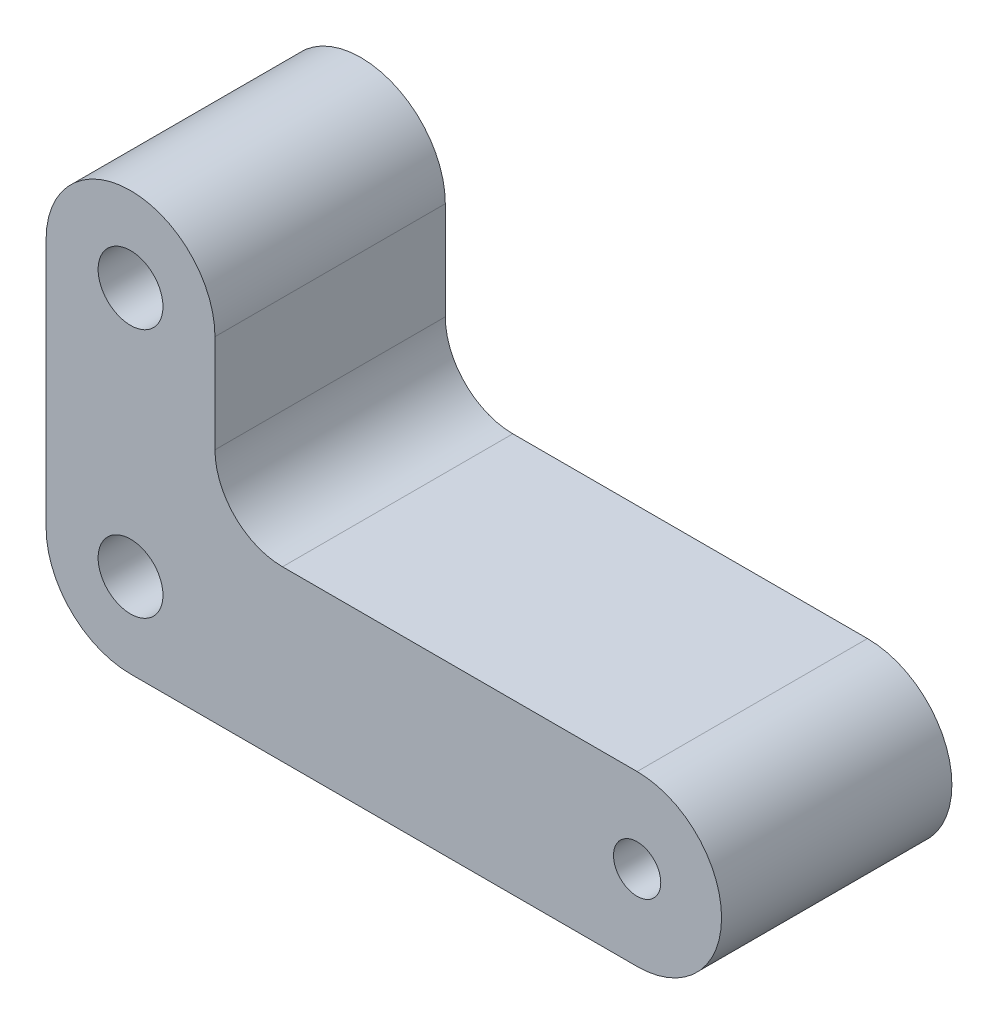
ISO-10303-21;
HEADER;
FILE_DESCRIPTION(('STEP AP214'),'2;1');
FILE_NAME('part.step','',(''),(''),'','','');
FILE_SCHEMA(('AUTOMOTIVE_DESIGN { 1 0 10303 214 1 1 1 1 }'));
ENDSEC;
DATA;
#1=APPLICATION_CONTEXT('core data for automotive mechanical design processes');
#2=APPLICATION_PROTOCOL_DEFINITION('international standard','automotive_design',2000,#1);
#3=PRODUCT_CONTEXT('',#1,'mechanical');
#4=PRODUCT('Part','Part','',(#3));
#5=PRODUCT_RELATED_PRODUCT_CATEGORY('part','',(#4));
#6=PRODUCT_DEFINITION_FORMATION('','',#4);
#7=PRODUCT_DEFINITION_CONTEXT('part definition',#1,'design');
#8=PRODUCT_DEFINITION('design','',#6,#7);
#9=PRODUCT_DEFINITION_SHAPE('','',#8);
#10=(LENGTH_UNIT() NAMED_UNIT(*) SI_UNIT(.MILLI.,.METRE.));
#11=(NAMED_UNIT(*) PLANE_ANGLE_UNIT() SI_UNIT($,.RADIAN.));
#12=(NAMED_UNIT(*) SI_UNIT($,.STERADIAN.) SOLID_ANGLE_UNIT());
#13=UNCERTAINTY_MEASURE_WITH_UNIT(LENGTH_MEASURE(1.E-05),#10,'distance_accuracy_value','');
#14=(GEOMETRIC_REPRESENTATION_CONTEXT(3) GLOBAL_UNCERTAINTY_ASSIGNED_CONTEXT((#13)) GLOBAL_UNIT_ASSIGNED_CONTEXT((#10,
#11,#12)) REPRESENTATION_CONTEXT('',''));
#15=CARTESIAN_POINT('',(0.,0.,0.));
#16=DIRECTION('',(0.,0.,1.));
#17=DIRECTION('',(1.,0.,0.));
#18=AXIS2_PLACEMENT_3D('',#15,#16,#17);
#19=CARTESIAN_POINT('',(81.915,40.767,8.6614));
#20=DIRECTION('',(0.,0.,-1.));
#21=DIRECTION('',(-1.,0.,0.));
#22=AXIS2_PLACEMENT_3D('',#19,#20,#21);
#23=CYLINDRICAL_SURFACE('',#22,2.54);
#24=CARTESIAN_POINT('',(81.915,40.767,0.));
#25=DIRECTION('',(0.,0.,-1.));
#26=DIRECTION('',(1.,0.,0.));
#27=AXIS2_PLACEMENT_3D('',#24,#25,#26);
#28=CIRCLE('',#27,2.54);
#29=CARTESIAN_POINT('',(81.915,38.227,0.));
#30=VERTEX_POINT('',#29);
#31=CARTESIAN_POINT('',(79.375,40.767,0.));
#32=VERTEX_POINT('',#31);
#33=EDGE_CURVE('E129',#30,#32,#28,.T.);
#34=ORIENTED_EDGE('',*,*,#33,.T.);
#35=DIRECTION('',(0.,0.,-1.));
#36=VECTOR('',#35,1.);
#37=CARTESIAN_POINT('',(79.375,40.767,8.6614));
#38=LINE('',#37,#36);
#39=CARTESIAN_POINT('',(79.375,40.767,8.6614));
#40=VERTEX_POINT('',#39);
#41=EDGE_CURVE('E11',#40,#32,#38,.T.);
#42=ORIENTED_EDGE('',*,*,#41,.F.);
#43=CARTESIAN_POINT('',(81.915,40.767,8.6614));
#44=DIRECTION('',(0.,0.,-1.));
#45=DIRECTION('',(1.,0.,0.));
#46=AXIS2_PLACEMENT_3D('',#43,#44,#45);
#47=CIRCLE('',#46,2.54);
#48=CARTESIAN_POINT('',(81.915,38.227,8.6614));
#49=VERTEX_POINT('',#48);
#50=EDGE_CURVE('E144',#49,#40,#47,.T.);
#51=ORIENTED_EDGE('',*,*,#50,.F.);
#52=DIRECTION('',(0.,0.,-1.));
#53=VECTOR('',#52,1.);
#54=CARTESIAN_POINT('',(81.915,38.227,8.6614));
#55=LINE('',#54,#53);
#56=EDGE_CURVE('E125',#49,#30,#55,.T.);
#57=ORIENTED_EDGE('',*,*,#56,.T.);
#58=EDGE_LOOP('',(#34,#42,#51,#57));
#59=FACE_BOUND('',#58,.T.);
#60=ADVANCED_FACE('F33',(#59),#23,.F.);
#61=CARTESIAN_POINT('',(79.375,44.45,8.6614));
#62=DIRECTION('',(-1.,0.,0.));
#63=DIRECTION('',(0.,0.,1.));
#64=AXIS2_PLACEMENT_3D('',#61,#62,#63);
#65=PLANE('',#64);
#66=DIRECTION('',(0.,1.,0.));
#67=VECTOR('',#66,1.);
#68=CARTESIAN_POINT('',(79.375,44.45,0.));
#69=LINE('',#68,#67);
#70=CARTESIAN_POINT('',(79.375,44.45,0.));
#71=VERTEX_POINT('',#70);
#72=EDGE_CURVE('E132',#32,#71,#69,.T.);
#73=ORIENTED_EDGE('',*,*,#72,.T.);
#74=DIRECTION('',(0.,0.,-1.));
#75=VECTOR('',#74,1.);
#76=CARTESIAN_POINT('',(79.375,44.45,8.6614));
#77=LINE('',#76,#75);
#78=CARTESIAN_POINT('',(79.375,44.45,8.6614));
#79=VERTEX_POINT('',#78);
#80=EDGE_CURVE('E41',#79,#71,#77,.T.);
#81=ORIENTED_EDGE('',*,*,#80,.F.);
#82=DIRECTION('',(0.,1.,0.));
#83=VECTOR('',#82,1.);
#84=CARTESIAN_POINT('',(79.375,44.45,8.6614));
#85=LINE('',#84,#83);
#86=EDGE_CURVE('E92',#40,#79,#85,.T.);
#87=ORIENTED_EDGE('',*,*,#86,.F.);
#88=ORIENTED_EDGE('',*,*,#41,.T.);
#89=EDGE_LOOP('',(#73,#81,#87,#88));
#90=FACE_BOUND('',#89,.T.);
#91=ADVANCED_FACE('F220',(#90),#65,.F.);
#92=CARTESIAN_POINT('',(76.2,44.45,8.6614));
#93=DIRECTION('',(0.,0.,-1.));
#94=DIRECTION('',(-1.,0.,0.));
#95=AXIS2_PLACEMENT_3D('',#92,#93,#94);
#96=CYLINDRICAL_SURFACE('',#95,3.175);
#97=CARTESIAN_POINT('',(76.2,44.45,0.));
#98=DIRECTION('',(0.,0.,1.));
#99=DIRECTION('',(1.,0.,0.));
#100=AXIS2_PLACEMENT_3D('',#97,#98,#99);
#101=CIRCLE('',#100,3.175);
#102=CARTESIAN_POINT('',(73.025,44.45,0.));
#103=VERTEX_POINT('',#102);
#104=EDGE_CURVE('E135',#71,#103,#101,.T.);
#105=ORIENTED_EDGE('',*,*,#104,.T.);
#106=DIRECTION('',(0.,0.,-1.));
#107=VECTOR('',#106,1.);
#108=CARTESIAN_POINT('',(73.025,44.45,8.6614));
#109=LINE('',#108,#107);
#110=CARTESIAN_POINT('',(73.025,44.45,8.6614));
#111=VERTEX_POINT('',#110);
#112=EDGE_CURVE('E151',#111,#103,#109,.T.);
#113=ORIENTED_EDGE('',*,*,#112,.F.);
#114=CARTESIAN_POINT('',(76.2,44.45,8.6614));
#115=DIRECTION('',(0.,0.,1.));
#116=DIRECTION('',(1.,0.,0.));
#117=AXIS2_PLACEMENT_3D('',#114,#115,#116);
#118=CIRCLE('',#117,3.175);
#119=EDGE_CURVE('E159',#79,#111,#118,.T.);
#120=ORIENTED_EDGE('',*,*,#119,.F.);
#121=ORIENTED_EDGE('',*,*,#80,.T.);
#122=EDGE_LOOP('',(#105,#113,#120,#121));
#123=FACE_BOUND('',#122,.T.);
#124=ADVANCED_FACE('F157',(#123),#96,.T.);
#125=CARTESIAN_POINT('',(73.025,35.052,8.6614));
#126=DIRECTION('',(1.,0.,0.));
#127=DIRECTION('',(0.,0.,-1.));
#128=AXIS2_PLACEMENT_3D('',#125,#126,#127);
#129=PLANE('',#128);
#130=DIRECTION('',(0.,-1.,0.));
#131=VECTOR('',#130,1.);
#132=CARTESIAN_POINT('',(73.025,35.052,0.));
#133=LINE('',#132,#131);
#134=CARTESIAN_POINT('',(73.025,35.052,0.));
#135=VERTEX_POINT('',#134);
#136=EDGE_CURVE('E137',#103,#135,#133,.T.);
#137=ORIENTED_EDGE('',*,*,#136,.T.);
#138=DIRECTION('',(0.,0.,-1.));
#139=VECTOR('',#138,1.);
#140=CARTESIAN_POINT('',(73.025,35.052,8.6614));
#141=LINE('',#140,#139);
#142=CARTESIAN_POINT('',(73.025,35.052,8.6614));
#143=VERTEX_POINT('',#142);
#144=EDGE_CURVE('E148',#143,#135,#141,.T.);
#145=ORIENTED_EDGE('',*,*,#144,.F.);
#146=DIRECTION('',(0.,-1.,0.));
#147=VECTOR('',#146,1.);
#148=CARTESIAN_POINT('',(73.025,35.052,8.6614));
#149=LINE('',#148,#147);
#150=EDGE_CURVE('E171',#111,#143,#149,.T.);
#151=ORIENTED_EDGE('',*,*,#150,.F.);
#152=ORIENTED_EDGE('',*,*,#112,.T.);
#153=EDGE_LOOP('',(#137,#145,#151,#152));
#154=FACE_BOUND('',#153,.T.);
#155=ADVANCED_FACE('F167',(#154),#129,.F.);
#156=CARTESIAN_POINT('',(76.2,35.052,8.6614));
#157=DIRECTION('',(0.,0.,-1.));
#158=DIRECTION('',(-1.,0.,0.));
#159=AXIS2_PLACEMENT_3D('',#156,#157,#158);
#160=CYLINDRICAL_SURFACE('',#159,3.175);
#161=CARTESIAN_POINT('',(76.2,35.052,0.));
#162=DIRECTION('',(0.,0.,1.));
#163=DIRECTION('',(1.,0.,0.));
#164=AXIS2_PLACEMENT_3D('',#161,#162,#163);
#165=CIRCLE('',#164,3.175);
#166=CARTESIAN_POINT('',(76.2,31.877,0.));
#167=VERTEX_POINT('',#166);
#168=EDGE_CURVE('E139',#135,#167,#165,.T.);
#169=ORIENTED_EDGE('',*,*,#168,.T.);
#170=DIRECTION('',(0.,0.,-1.));
#171=VECTOR('',#170,1.);
#172=CARTESIAN_POINT('',(76.2,31.877,8.6614));
#173=LINE('',#172,#171);
#174=CARTESIAN_POINT('',(76.2,31.877,8.6614));
#175=VERTEX_POINT('',#174);
#176=EDGE_CURVE('E120',#175,#167,#173,.T.);
#177=ORIENTED_EDGE('',*,*,#176,.F.);
#178=CARTESIAN_POINT('',(76.2,35.052,8.6614));
#179=DIRECTION('',(0.,0.,1.));
#180=DIRECTION('',(1.,0.,0.));
#181=AXIS2_PLACEMENT_3D('',#178,#179,#180);
#182=CIRCLE('',#181,3.175);
#183=EDGE_CURVE('E111',#143,#175,#182,.T.);
#184=ORIENTED_EDGE('',*,*,#183,.F.);
#185=ORIENTED_EDGE('',*,*,#144,.T.);
#186=EDGE_LOOP('',(#169,#177,#184,#185));
#187=FACE_BOUND('',#186,.T.);
#188=ADVANCED_FACE('F170',(#187),#160,.T.);
#189=CARTESIAN_POINT('',(95.25,31.877,8.6614));
#190=DIRECTION('',(0.,1.,0.));
#191=DIRECTION('',(0.,0.,1.));
#192=AXIS2_PLACEMENT_3D('',#189,#190,#191);
#193=PLANE('',#192);
#194=DIRECTION('',(1.,0.,0.));
#195=VECTOR('',#194,1.);
#196=CARTESIAN_POINT('',(95.25,31.877,0.));
#197=LINE('',#196,#195);
#198=CARTESIAN_POINT('',(95.25,31.877,0.));
#199=VERTEX_POINT('',#198);
#200=EDGE_CURVE('E119',#167,#199,#197,.T.);
#201=ORIENTED_EDGE('',*,*,#200,.T.);
#202=DIRECTION('',(0.,0.,-1.));
#203=VECTOR('',#202,1.);
#204=CARTESIAN_POINT('',(95.25,31.877,8.6614));
#205=LINE('',#204,#203);
#206=CARTESIAN_POINT('',(95.25,31.877,8.6614));
#207=VERTEX_POINT('',#206);
#208=EDGE_CURVE('E116',#207,#199,#205,.T.);
#209=ORIENTED_EDGE('',*,*,#208,.F.);
#210=DIRECTION('',(1.,0.,0.));
#211=VECTOR('',#210,1.);
#212=CARTESIAN_POINT('',(95.25,31.877,8.6614));
#213=LINE('',#212,#211);
#214=EDGE_CURVE('E105',#175,#207,#213,.T.);
#215=ORIENTED_EDGE('',*,*,#214,.F.);
#216=ORIENTED_EDGE('',*,*,#176,.T.);
#217=EDGE_LOOP('',(#201,#209,#215,#216));
#218=FACE_BOUND('',#217,.T.);
#219=ADVANCED_FACE('F117',(#218),#193,.F.);
#220=CARTESIAN_POINT('',(95.25,35.052,8.6614));
#221=DIRECTION('',(0.,0.,-1.));
#222=DIRECTION('',(-1.,0.,0.));
#223=AXIS2_PLACEMENT_3D('',#220,#221,#222);
#224=CYLINDRICAL_SURFACE('',#223,3.175);
#225=CARTESIAN_POINT('',(95.25,35.052,0.));
#226=DIRECTION('',(0.,0.,1.));
#227=DIRECTION('',(1.,0.,0.));
#228=AXIS2_PLACEMENT_3D('',#225,#226,#227);
#229=CIRCLE('',#228,3.175);
#230=CARTESIAN_POINT('',(95.25,38.227,0.));
#231=VERTEX_POINT('',#230);
#232=EDGE_CURVE('E78',#199,#231,#229,.T.);
#233=ORIENTED_EDGE('',*,*,#232,.T.);
#234=DIRECTION('',(0.,0.,-1.));
#235=VECTOR('',#234,1.);
#236=CARTESIAN_POINT('',(95.25,38.227,8.6614));
#237=LINE('',#236,#235);
#238=CARTESIAN_POINT('',(95.25,38.227,8.6614));
#239=VERTEX_POINT('',#238);
#240=EDGE_CURVE('E121',#239,#231,#237,.T.);
#241=ORIENTED_EDGE('',*,*,#240,.F.);
#242=CARTESIAN_POINT('',(95.25,35.052,8.6614));
#243=DIRECTION('',(0.,0.,1.));
#244=DIRECTION('',(1.,0.,0.));
#245=AXIS2_PLACEMENT_3D('',#242,#243,#244);
#246=CIRCLE('',#245,3.175);
#247=EDGE_CURVE('E109',#207,#239,#246,.T.);
#248=ORIENTED_EDGE('',*,*,#247,.F.);
#249=ORIENTED_EDGE('',*,*,#208,.T.);
#250=EDGE_LOOP('',(#233,#241,#248,#249));
#251=FACE_BOUND('',#250,.T.);
#252=ADVANCED_FACE('F123',(#251),#224,.T.);
#253=CARTESIAN_POINT('',(81.915,38.227,8.6614));
#254=DIRECTION('',(0.,-1.,0.));
#255=DIRECTION('',(0.,0.,-1.));
#256=AXIS2_PLACEMENT_3D('',#253,#254,#255);
#257=PLANE('',#256);
#258=DIRECTION('',(-1.,0.,0.));
#259=VECTOR('',#258,1.);
#260=CARTESIAN_POINT('',(81.915,38.227,0.));
#261=LINE('',#260,#259);
#262=EDGE_CURVE('E84',#231,#30,#261,.T.);
#263=ORIENTED_EDGE('',*,*,#262,.T.);
#264=ORIENTED_EDGE('',*,*,#56,.F.);
#265=DIRECTION('',(-1.,0.,0.));
#266=VECTOR('',#265,1.);
#267=CARTESIAN_POINT('',(81.915,38.227,8.6614));
#268=LINE('',#267,#266);
#269=EDGE_CURVE('E49',#239,#49,#268,.T.);
#270=ORIENTED_EDGE('',*,*,#269,.F.);
#271=ORIENTED_EDGE('',*,*,#240,.T.);
#272=EDGE_LOOP('',(#263,#264,#270,#271));
#273=FACE_BOUND('',#272,.T.);
#274=ADVANCED_FACE('F199',(#273),#257,.F.);
#275=CARTESIAN_POINT('',(81.915,40.767,8.6614));
#276=DIRECTION('',(0.,0.,1.));
#277=DIRECTION('',(1.,0.,0.));
#278=AXIS2_PLACEMENT_3D('',#275,#276,#277);
#279=PLANE('',#278);
#280=CARTESIAN_POINT('',(95.25,35.052,8.6614));
#281=DIRECTION('',(0.,0.,1.));
#282=DIRECTION('',(1.,0.,0.));
#283=AXIS2_PLACEMENT_3D('',#280,#281,#282);
#284=CIRCLE('',#283,0.889000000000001);
#285=CARTESIAN_POINT('',(96.139,35.052,8.6614));
#286=VERTEX_POINT('',#285);
#287=EDGE_CURVE('E191',#286,#286,#284,.T.);
#288=ORIENTED_EDGE('',*,*,#287,.F.);
#289=EDGE_LOOP('',(#288));
#290=FACE_BOUND('',#289,.T.);
#291=CARTESIAN_POINT('',(76.2,44.45,8.6614));
#292=DIRECTION('',(0.,0.,1.));
#293=DIRECTION('',(1.,0.,0.));
#294=AXIS2_PLACEMENT_3D('',#291,#292,#293);
#295=CIRCLE('',#294,1.2192);
#296=CARTESIAN_POINT('',(77.4192,44.45,8.6614));
#297=VERTEX_POINT('',#296);
#298=EDGE_CURVE('E185',#297,#297,#295,.T.);
#299=ORIENTED_EDGE('',*,*,#298,.F.);
#300=EDGE_LOOP('',(#299));
#301=FACE_BOUND('',#300,.T.);
#302=CARTESIAN_POINT('',(76.2,35.052,8.6614));
#303=DIRECTION('',(0.,0.,1.));
#304=DIRECTION('',(1.,0.,0.));
#305=AXIS2_PLACEMENT_3D('',#302,#303,#304);
#306=CIRCLE('',#305,1.2192);
#307=CARTESIAN_POINT('',(77.4192,35.052,8.6614));
#308=VERTEX_POINT('',#307);
#309=EDGE_CURVE('E179',#308,#308,#306,.T.);
#310=ORIENTED_EDGE('',*,*,#309,.F.);
#311=EDGE_LOOP('',(#310));
#312=FACE_BOUND('',#311,.T.);
#313=ORIENTED_EDGE('',*,*,#50,.T.);
#314=ORIENTED_EDGE('',*,*,#86,.T.);
#315=ORIENTED_EDGE('',*,*,#119,.T.);
#316=ORIENTED_EDGE('',*,*,#150,.T.);
#317=ORIENTED_EDGE('',*,*,#183,.T.);
#318=ORIENTED_EDGE('',*,*,#214,.T.);
#319=ORIENTED_EDGE('',*,*,#247,.T.);
#320=ORIENTED_EDGE('',*,*,#269,.T.);
#321=EDGE_LOOP('',(#313,#314,#315,#316,#317,#318,#319,#320));
#322=FACE_BOUND('',#321,.T.);
#323=ADVANCED_FACE('F107',(#290,#301,#312,#322),#279,.T.);
#324=CARTESIAN_POINT('',(81.915,40.767,0.));
#325=DIRECTION('',(0.,0.,1.));
#326=DIRECTION('',(1.,0.,0.));
#327=AXIS2_PLACEMENT_3D('',#324,#325,#326);
#328=PLANE('',#327);
#329=CARTESIAN_POINT('',(95.25,35.052,0.));
#330=DIRECTION('',(0.,0.,1.));
#331=DIRECTION('',(1.,0.,0.));
#332=AXIS2_PLACEMENT_3D('',#329,#330,#331);
#333=CIRCLE('',#332,0.889000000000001);
#334=CARTESIAN_POINT('',(96.139,35.052,0.));
#335=VERTEX_POINT('',#334);
#336=EDGE_CURVE('E188',#335,#335,#333,.T.);
#337=ORIENTED_EDGE('',*,*,#336,.T.);
#338=EDGE_LOOP('',(#337));
#339=FACE_BOUND('',#338,.T.);
#340=CARTESIAN_POINT('',(76.2,44.45,0.));
#341=DIRECTION('',(0.,0.,1.));
#342=DIRECTION('',(1.,0.,0.));
#343=AXIS2_PLACEMENT_3D('',#340,#341,#342);
#344=CIRCLE('',#343,1.2192);
#345=CARTESIAN_POINT('',(77.4192,44.45,0.));
#346=VERTEX_POINT('',#345);
#347=EDGE_CURVE('E182',#346,#346,#344,.T.);
#348=ORIENTED_EDGE('',*,*,#347,.T.);
#349=EDGE_LOOP('',(#348));
#350=FACE_BOUND('',#349,.T.);
#351=CARTESIAN_POINT('',(76.2,35.052,0.));
#352=DIRECTION('',(0.,0.,1.));
#353=DIRECTION('',(1.,0.,0.));
#354=AXIS2_PLACEMENT_3D('',#351,#352,#353);
#355=CIRCLE('',#354,1.2192);
#356=CARTESIAN_POINT('',(77.4192,35.052,0.));
#357=VERTEX_POINT('',#356);
#358=EDGE_CURVE('E133',#357,#357,#355,.T.);
#359=ORIENTED_EDGE('',*,*,#358,.T.);
#360=EDGE_LOOP('',(#359));
#361=FACE_BOUND('',#360,.T.);
#362=ORIENTED_EDGE('',*,*,#33,.F.);
#363=ORIENTED_EDGE('',*,*,#262,.F.);
#364=ORIENTED_EDGE('',*,*,#232,.F.);
#365=ORIENTED_EDGE('',*,*,#200,.F.);
#366=ORIENTED_EDGE('',*,*,#168,.F.);
#367=ORIENTED_EDGE('',*,*,#136,.F.);
#368=ORIENTED_EDGE('',*,*,#104,.F.);
#369=ORIENTED_EDGE('',*,*,#72,.F.);
#370=EDGE_LOOP('',(#362,#363,#364,#365,#366,#367,#368,#369));
#371=FACE_BOUND('',#370,.T.);
#372=ADVANCED_FACE('F163',(#339,#350,#361,#371),#328,.F.);
#373=CARTESIAN_POINT('',(76.2,35.052,8.6614));
#374=DIRECTION('',(0.,0.,1.));
#375=DIRECTION('',(1.,0.,0.));
#376=AXIS2_PLACEMENT_3D('',#373,#374,#375);
#377=CYLINDRICAL_SURFACE('',#376,1.2192);
#378=ORIENTED_EDGE('',*,*,#358,.F.);
#379=EDGE_LOOP('',(#378));
#380=FACE_BOUND('',#379,.T.);
#381=ORIENTED_EDGE('',*,*,#309,.T.);
#382=EDGE_LOOP('',(#381));
#383=FACE_BOUND('',#382,.T.);
#384=ADVANCED_FACE('F205',(#380,#383),#377,.F.);
#385=CARTESIAN_POINT('',(76.2,44.45,8.6614));
#386=DIRECTION('',(0.,0.,1.));
#387=DIRECTION('',(1.,0.,0.));
#388=AXIS2_PLACEMENT_3D('',#385,#386,#387);
#389=CYLINDRICAL_SURFACE('',#388,1.2192);
#390=ORIENTED_EDGE('',*,*,#347,.F.);
#391=EDGE_LOOP('',(#390));
#392=FACE_BOUND('',#391,.T.);
#393=ORIENTED_EDGE('',*,*,#298,.T.);
#394=EDGE_LOOP('',(#393));
#395=FACE_BOUND('',#394,.T.);
#396=ADVANCED_FACE('F207',(#392,#395),#389,.F.);
#397=CARTESIAN_POINT('',(95.25,35.052,8.6614));
#398=DIRECTION('',(0.,0.,1.));
#399=DIRECTION('',(1.,0.,0.));
#400=AXIS2_PLACEMENT_3D('',#397,#398,#399);
#401=CYLINDRICAL_SURFACE('',#400,0.889000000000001);
#402=ORIENTED_EDGE('',*,*,#336,.F.);
#403=EDGE_LOOP('',(#402));
#404=FACE_BOUND('',#403,.T.);
#405=ORIENTED_EDGE('',*,*,#287,.T.);
#406=EDGE_LOOP('',(#405));
#407=FACE_BOUND('',#406,.T.);
#408=ADVANCED_FACE('F195',(#404,#407),#401,.F.);
#409=CLOSED_SHELL('',(#60,#91,#124,#155,#188,#219,#252,#274,#323,#372,#384,#396,#408));
#410=MANIFOLD_SOLID_BREP('B2',#409);
#411=ADVANCED_BREP_SHAPE_REPRESENTATION('',(#18,#410),#14);
#412=SHAPE_DEFINITION_REPRESENTATION(#9,#411);
ENDSEC;
END-ISO-10303-21;
